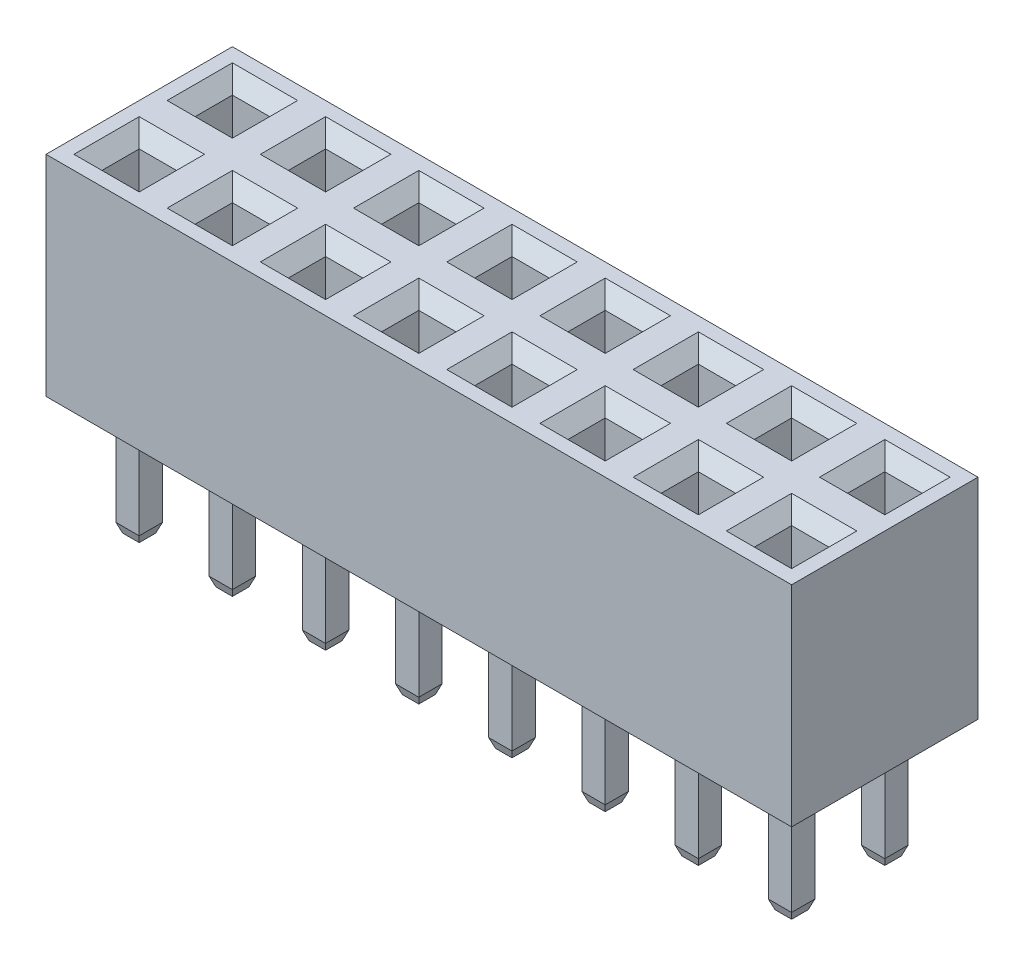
from build123d import *
from OCP.BRepFilletAPI import BRepFilletAPI_MakeChamfer

# Parameters (mm, degrees)
SKETCH_2_W                          = 2
SKETCH_2_H                          = 4
EXTRUDE_2_DEPTH                     = 4.5
SKETCH_3_W                          = 0.8
SKETCH_3_H                          = 0.8
CUT_EXTRUDE_1_DEPTH                 = 4
CHAMFER_3_SIZE                      = 0.3
SKETCH_1_W                          = 0.5
SKETCH_1_H                          = 0.5
EXTRUDE_1_DEPTH                     = 2.54
CHAMFER_1_SIZE                      = 0.2
CHAMFER_1_SIZE2                     = 0.072794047
PATTERN_LINEAR_1_COUNT              = 8
PATTERN_LINEAR_1_PITCH              = 2
CHAMFER_3_OF_PATTERN_LINEAR_1_SIZE  = 0.3
PATTERN_LINEAR_3_COUNT              = 100
PATTERN_LINEAR_3_PITCH              = 2
CHAMFER_1_OF_PATTERN_LINEAR_3_SIZE  = 0.2
CHAMFER_1_OF_PATTERN_LINEAR_3_SIZE2 = 0.072794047


with BuildPart() as part:
    # Sketch 2 → Extrude 2 (new body)
    with BuildSketch(Plane(origin=(0, 0, 0), x_dir=(1, 0, 0), z_dir=(0, 1, 0))):
        with Locations((0, 1)):
            Rectangle(SKETCH_2_W, SKETCH_2_H)
    extrude_2 = extrude(amount=EXTRUDE_2_DEPTH)

    # Sketch 3 → Cut-Extrude 1 (cut)
    with BuildSketch(Plane(origin=(0, 4.5, 0), x_dir=(-1, 0, 0), z_dir=(0, 1, 0))):
        Rectangle(SKETCH_3_W, SKETCH_3_H)
        with Locations((0, -2)):
            Rectangle(SKETCH_3_W, SKETCH_3_H)
    cut_extrude_1 = extrude(amount=-CUT_EXTRUDE_1_DEPTH, mode=Mode.SUBTRACT)

    # Chamfer 3
    chamfer_3_edges = [part.edges().sort_by_distance(p)[0] for p in [
        (-0.4, 4.5, 0),
        (0, 4.5, 0.4),
        (0.4, 4.5, 0),
        (0, 4.5, -0.4),
        (-0.4, 4.5, -2),
        (0, 4.5, -1.6),
        (0.4, 4.5, -2),
        (0, 4.5, -2.4),
    ]]
    chamfer(chamfer_3_edges, length=CHAMFER_3_SIZE)

    # Sketch 1 → Extrude 1 (add)
    with BuildSketch(Plane(origin=(0, 0, 0), x_dir=(1, 0, 0), z_dir=(0, 1, 0))):
        Rectangle(SKETCH_1_W, SKETCH_1_H)
        with Locations((0, 2)):
            Rectangle(SKETCH_1_W, SKETCH_1_H)
    extrude_1 = extrude(amount=-EXTRUDE_1_DEPTH)

    # Chamfer 1: one chamfer whose edges measure the first distance from different faces: ONE call of the kernel's chamfer builder (chamfer() names one face for all edges)
    chamfer_1_edges_1 = [part.edges().sort_by_distance(p)[0] for p in [
        (-0.25, -2.54, 0),
    ]]
    chamfer_1_side_1 = [part.faces().sort_by_distance(p)[0] for p in [
        (-0.25, -1.27, 0),
    ]]
    chamfer_1_edges_2 = [part.edges().sort_by_distance(p)[0] for p in [
        (0, -2.54, -0.25),
    ]]
    chamfer_1_side_2 = [part.faces().sort_by_distance(p)[0] for p in [
        (0, -1.27, -0.25),
    ]]
    chamfer_1_edges_3 = [part.edges().sort_by_distance(p)[0] for p in [
        (0.25, -2.54, 0),
    ]]
    chamfer_1_side_3 = [part.faces().sort_by_distance(p)[0] for p in [
        (0.25, -1.27, 0),
    ]]
    chamfer_1_edges_4 = [part.edges().sort_by_distance(p)[0] for p in [
        (0, -2.54, 0.25),
    ]]
    chamfer_1_side_4 = [part.faces().sort_by_distance(p)[0] for p in [
        (0, -1.27, 0.25),
    ]]
    chamfer_1_edges_5 = [part.edges().sort_by_distance(p)[0] for p in [
        (-0.25, -2.54, -2),
    ]]
    chamfer_1_side_5 = [part.faces().sort_by_distance(p)[0] for p in [
        (-0.25, -1.27, -2),
    ]]
    chamfer_1_edges_6 = [part.edges().sort_by_distance(p)[0] for p in [
        (0, -2.54, -2.25),
    ]]
    chamfer_1_side_6 = [part.faces().sort_by_distance(p)[0] for p in [
        (0, -1.27, -2.25),
    ]]
    chamfer_1_edges_7 = [part.edges().sort_by_distance(p)[0] for p in [
        (0.25, -2.54, -2),
    ]]
    chamfer_1_side_7 = [part.faces().sort_by_distance(p)[0] for p in [
        (0.25, -1.27, -2),
    ]]
    chamfer_1_edges_8 = [part.edges().sort_by_distance(p)[0] for p in [
        (0, -2.54, -1.75),
    ]]
    chamfer_1_side_8 = [part.faces().sort_by_distance(p)[0] for p in [
        (0, -1.27, -1.75),
    ]]
    chamfer_1 = BRepFilletAPI_MakeChamfer(part.part.solid().wrapped)
    for e in chamfer_1_edges_1:
        chamfer_1.Add(CHAMFER_1_SIZE, CHAMFER_1_SIZE2, e.wrapped, chamfer_1_side_1[0].wrapped)  # the first distance lies on this face
    for e in chamfer_1_edges_2:
        chamfer_1.Add(CHAMFER_1_SIZE, CHAMFER_1_SIZE2, e.wrapped, chamfer_1_side_2[0].wrapped)  # the first distance lies on this face
    for e in chamfer_1_edges_3:
        chamfer_1.Add(CHAMFER_1_SIZE, CHAMFER_1_SIZE2, e.wrapped, chamfer_1_side_3[0].wrapped)  # the first distance lies on this face
    for e in chamfer_1_edges_4:
        chamfer_1.Add(CHAMFER_1_SIZE, CHAMFER_1_SIZE2, e.wrapped, chamfer_1_side_4[0].wrapped)  # the first distance lies on this face
    for e in chamfer_1_edges_5:
        chamfer_1.Add(CHAMFER_1_SIZE, CHAMFER_1_SIZE2, e.wrapped, chamfer_1_side_5[0].wrapped)  # the first distance lies on this face
    for e in chamfer_1_edges_6:
        chamfer_1.Add(CHAMFER_1_SIZE, CHAMFER_1_SIZE2, e.wrapped, chamfer_1_side_6[0].wrapped)  # the first distance lies on this face
    for e in chamfer_1_edges_7:
        chamfer_1.Add(CHAMFER_1_SIZE, CHAMFER_1_SIZE2, e.wrapped, chamfer_1_side_7[0].wrapped)  # the first distance lies on this face
    for e in chamfer_1_edges_8:
        chamfer_1.Add(CHAMFER_1_SIZE, CHAMFER_1_SIZE2, e.wrapped, chamfer_1_side_8[0].wrapped)  # the first distance lies on this face
    add(Compound.cast(chamfer_1.Shape()), mode=Mode.REPLACE)

    # Pattern Linear 1: Extrude 2, Cut-Extrude 1 ×8
    with Locations(*[(-i * PATTERN_LINEAR_1_PITCH, 0, 0) for i in range(1, PATTERN_LINEAR_1_COUNT)]):
        add(extrude_2)
        add(cut_extrude_1, mode=Mode.SUBTRACT)

    # Chamfer 3 of Pattern Linear 1
    chamfer_3_of_pattern_linear_1_edges = [part.edges().sort_by_distance(p)[0] for p in [
        (-2.4, 4.5, 0),
        (-2, 4.5, 0.4),
        (-1.6, 4.5, 0),
        (-2, 4.5, -0.4),
        (-2.4, 4.5, -2),
        (-2, 4.5, -1.6),
        (-1.6, 4.5, -2),
        (-2, 4.5, -2.4),
        (-4.4, 4.5, 0),
        (-4, 4.5, 0.4),
        (-3.6, 4.5, 0),
        (-4, 4.5, -0.4),
        (-4.4, 4.5, -2),
        (-4, 4.5, -1.6),
        (-3.6, 4.5, -2),
        (-4, 4.5, -2.4),
        (-6.4, 4.5, 0),
        (-6, 4.5, 0.4),
        (-5.6, 4.5, 0),
        (-6, 4.5, -0.4),
        (-6.4, 4.5, -2),
        (-6, 4.5, -1.6),
        (-5.6, 4.5, -2),
        (-6, 4.5, -2.4),
        (-8.4, 4.5, 0),
        (-8, 4.5, 0.4),
        (-7.6, 4.5, 0),
        (-8, 4.5, -0.4),
        (-8.4, 4.5, -2),
        (-8, 4.5, -1.6),
        (-7.6, 4.5, -2),
        (-8, 4.5, -2.4),
        (-10.4, 4.5, 0),
        (-10, 4.5, 0.4),
        (-9.6, 4.5, 0),
        (-10, 4.5, -0.4),
        (-10.4, 4.5, -2),
        (-10, 4.5, -1.6),
        (-9.6, 4.5, -2),
        (-10, 4.5, -2.4),
        (-12.4, 4.5, 0),
        (-12, 4.5, 0.4),
        (-11.6, 4.5, 0),
        (-12, 4.5, -0.4),
        (-12.4, 4.5, -2),
        (-12, 4.5, -1.6),
        (-11.6, 4.5, -2),
        (-12, 4.5, -2.4),
        (-14.4, 4.5, 0),
        (-14, 4.5, 0.4),
        (-13.6, 4.5, 0),
        (-14, 4.5, -0.4),
        (-14.4, 4.5, -2),
        (-14, 4.5, -1.6),
        (-13.6, 4.5, -2),
        (-14, 4.5, -2.4),
    ]]
    chamfer(chamfer_3_of_pattern_linear_1_edges, length=CHAMFER_3_OF_PATTERN_LINEAR_1_SIZE)

    # Pattern Linear 3: Extrude 1 ×100, 92 skipped
    with Locations(*[(-i * PATTERN_LINEAR_3_PITCH, 0, 0) for i in range(1, PATTERN_LINEAR_3_COUNT) if i not in (8, 9, 10, 11, 12, 13, 14, 15, 16, 17, 18, 19, 20, 21, 22, 23, 24, 25, 26, 27, 28, 29, 30, 31, 32, 33, 34, 35, 36, 37, 38, 39, 40, 41, 42, 43, 44, 45, 46, 47, 48, 49, 50, 51, 52, 53, 54, 55, 56, 57, 58, 59, 60, 61, 62, 63, 64, 65, 66, 67, 68, 69, 70, 71, 72, 73, 74, 75, 76, 77, 78, 79, 80, 81, 82, 83, 84, 85, 86, 87, 88, 89, 90, 91, 92, 93, 94, 95, 96, 97, 98, 99)]):
        add(extrude_1)

    # Chamfer 1 of Pattern Linear 3: one chamfer whose edges measure the first distance from different faces: ONE call of the kernel's chamfer builder (chamfer() names one face for all edges)
    chamfer_1_of_pattern_linear_3_edges_1 = [part.edges().sort_by_distance(p)[0] for p in [
        (-2.25, -2.54, 0),
    ]]
    chamfer_1_of_pattern_linear_3_side_1 = [part.faces().sort_by_distance(p)[0] for p in [
        (-2.25, -1.27, 0),
    ]]
    chamfer_1_of_pattern_linear_3_edges_2 = [part.edges().sort_by_distance(p)[0] for p in [
        (-2, -2.54, -0.25),
    ]]
    chamfer_1_of_pattern_linear_3_side_2 = [part.faces().sort_by_distance(p)[0] for p in [
        (-2, -1.27, -0.25),
    ]]
    chamfer_1_of_pattern_linear_3_edges_3 = [part.edges().sort_by_distance(p)[0] for p in [
        (-1.75, -2.54, 0),
    ]]
    chamfer_1_of_pattern_linear_3_side_3 = [part.faces().sort_by_distance(p)[0] for p in [
        (-1.75, -1.27, 0),
    ]]
    chamfer_1_of_pattern_linear_3_edges_4 = [part.edges().sort_by_distance(p)[0] for p in [
        (-2, -2.54, 0.25),
    ]]
    chamfer_1_of_pattern_linear_3_side_4 = [part.faces().sort_by_distance(p)[0] for p in [
        (-2, -1.27, 0.25),
    ]]
    chamfer_1_of_pattern_linear_3_edges_5 = [part.edges().sort_by_distance(p)[0] for p in [
        (-2.25, -2.54, -2),
    ]]
    chamfer_1_of_pattern_linear_3_side_5 = [part.faces().sort_by_distance(p)[0] for p in [
        (-2.25, -1.27, -2),
    ]]
    chamfer_1_of_pattern_linear_3_edges_6 = [part.edges().sort_by_distance(p)[0] for p in [
        (-2, -2.54, -2.25),
    ]]
    chamfer_1_of_pattern_linear_3_side_6 = [part.faces().sort_by_distance(p)[0] for p in [
        (-2, -1.27, -2.25),
    ]]
    chamfer_1_of_pattern_linear_3_edges_7 = [part.edges().sort_by_distance(p)[0] for p in [
        (-1.75, -2.54, -2),
    ]]
    chamfer_1_of_pattern_linear_3_side_7 = [part.faces().sort_by_distance(p)[0] for p in [
        (-1.75, -1.27, -2),
    ]]
    chamfer_1_of_pattern_linear_3_edges_8 = [part.edges().sort_by_distance(p)[0] for p in [
        (-2, -2.54, -1.75),
    ]]
    chamfer_1_of_pattern_linear_3_side_8 = [part.faces().sort_by_distance(p)[0] for p in [
        (-2, -1.27, -1.75),
    ]]
    chamfer_1_of_pattern_linear_3_edges_9 = [part.edges().sort_by_distance(p)[0] for p in [
        (-4.25, -2.54, 0),
    ]]
    chamfer_1_of_pattern_linear_3_side_9 = [part.faces().sort_by_distance(p)[0] for p in [
        (-4.25, -1.27, 0),
    ]]
    chamfer_1_of_pattern_linear_3_edges_10 = [part.edges().sort_by_distance(p)[0] for p in [
        (-4, -2.54, -0.25),
    ]]
    chamfer_1_of_pattern_linear_3_side_10 = [part.faces().sort_by_distance(p)[0] for p in [
        (-4, -1.27, -0.25),
    ]]
    chamfer_1_of_pattern_linear_3_edges_11 = [part.edges().sort_by_distance(p)[0] for p in [
        (-3.75, -2.54, 0),
    ]]
    chamfer_1_of_pattern_linear_3_side_11 = [part.faces().sort_by_distance(p)[0] for p in [
        (-3.75, -1.27, 0),
    ]]
    chamfer_1_of_pattern_linear_3_edges_12 = [part.edges().sort_by_distance(p)[0] for p in [
        (-4, -2.54, 0.25),
    ]]
    chamfer_1_of_pattern_linear_3_side_12 = [part.faces().sort_by_distance(p)[0] for p in [
        (-4, -1.27, 0.25),
    ]]
    chamfer_1_of_pattern_linear_3_edges_13 = [part.edges().sort_by_distance(p)[0] for p in [
        (-4.25, -2.54, -2),
    ]]
    chamfer_1_of_pattern_linear_3_side_13 = [part.faces().sort_by_distance(p)[0] for p in [
        (-4.25, -1.27, -2),
    ]]
    chamfer_1_of_pattern_linear_3_edges_14 = [part.edges().sort_by_distance(p)[0] for p in [
        (-4, -2.54, -2.25),
    ]]
    chamfer_1_of_pattern_linear_3_side_14 = [part.faces().sort_by_distance(p)[0] for p in [
        (-4, -1.27, -2.25),
    ]]
    chamfer_1_of_pattern_linear_3_edges_15 = [part.edges().sort_by_distance(p)[0] for p in [
        (-3.75, -2.54, -2),
    ]]
    chamfer_1_of_pattern_linear_3_side_15 = [part.faces().sort_by_distance(p)[0] for p in [
        (-3.75, -1.27, -2),
    ]]
    chamfer_1_of_pattern_linear_3_edges_16 = [part.edges().sort_by_distance(p)[0] for p in [
        (-4, -2.54, -1.75),
    ]]
    chamfer_1_of_pattern_linear_3_side_16 = [part.faces().sort_by_distance(p)[0] for p in [
        (-4, -1.27, -1.75),
    ]]
    chamfer_1_of_pattern_linear_3_edges_17 = [part.edges().sort_by_distance(p)[0] for p in [
        (-6.25, -2.54, 0),
    ]]
    chamfer_1_of_pattern_linear_3_side_17 = [part.faces().sort_by_distance(p)[0] for p in [
        (-6.25, -1.27, 0),
    ]]
    chamfer_1_of_pattern_linear_3_edges_18 = [part.edges().sort_by_distance(p)[0] for p in [
        (-6, -2.54, -0.25),
    ]]
    chamfer_1_of_pattern_linear_3_side_18 = [part.faces().sort_by_distance(p)[0] for p in [
        (-6, -1.27, -0.25),
    ]]
    chamfer_1_of_pattern_linear_3_edges_19 = [part.edges().sort_by_distance(p)[0] for p in [
        (-5.75, -2.54, 0),
    ]]
    chamfer_1_of_pattern_linear_3_side_19 = [part.faces().sort_by_distance(p)[0] for p in [
        (-5.75, -1.27, 0),
    ]]
    chamfer_1_of_pattern_linear_3_edges_20 = [part.edges().sort_by_distance(p)[0] for p in [
        (-6, -2.54, 0.25),
    ]]
    chamfer_1_of_pattern_linear_3_side_20 = [part.faces().sort_by_distance(p)[0] for p in [
        (-6, -1.27, 0.25),
    ]]
    chamfer_1_of_pattern_linear_3_edges_21 = [part.edges().sort_by_distance(p)[0] for p in [
        (-6.25, -2.54, -2),
    ]]
    chamfer_1_of_pattern_linear_3_side_21 = [part.faces().sort_by_distance(p)[0] for p in [
        (-6.25, -1.27, -2),
    ]]
    chamfer_1_of_pattern_linear_3_edges_22 = [part.edges().sort_by_distance(p)[0] for p in [
        (-6, -2.54, -2.25),
    ]]
    chamfer_1_of_pattern_linear_3_side_22 = [part.faces().sort_by_distance(p)[0] for p in [
        (-6, -1.27, -2.25),
    ]]
    chamfer_1_of_pattern_linear_3_edges_23 = [part.edges().sort_by_distance(p)[0] for p in [
        (-5.75, -2.54, -2),
    ]]
    chamfer_1_of_pattern_linear_3_side_23 = [part.faces().sort_by_distance(p)[0] for p in [
        (-5.75, -1.27, -2),
    ]]
    chamfer_1_of_pattern_linear_3_edges_24 = [part.edges().sort_by_distance(p)[0] for p in [
        (-6, -2.54, -1.75),
    ]]
    chamfer_1_of_pattern_linear_3_side_24 = [part.faces().sort_by_distance(p)[0] for p in [
        (-6, -1.27, -1.75),
    ]]
    chamfer_1_of_pattern_linear_3_edges_25 = [part.edges().sort_by_distance(p)[0] for p in [
        (-8.25, -2.54, 0),
    ]]
    chamfer_1_of_pattern_linear_3_side_25 = [part.faces().sort_by_distance(p)[0] for p in [
        (-8.25, -1.27, 0),
    ]]
    chamfer_1_of_pattern_linear_3_edges_26 = [part.edges().sort_by_distance(p)[0] for p in [
        (-8, -2.54, -0.25),
    ]]
    chamfer_1_of_pattern_linear_3_side_26 = [part.faces().sort_by_distance(p)[0] for p in [
        (-8, -1.27, -0.25),
    ]]
    chamfer_1_of_pattern_linear_3_edges_27 = [part.edges().sort_by_distance(p)[0] for p in [
        (-7.75, -2.54, 0),
    ]]
    chamfer_1_of_pattern_linear_3_side_27 = [part.faces().sort_by_distance(p)[0] for p in [
        (-7.75, -1.27, 0),
    ]]
    chamfer_1_of_pattern_linear_3_edges_28 = [part.edges().sort_by_distance(p)[0] for p in [
        (-8, -2.54, 0.25),
    ]]
    chamfer_1_of_pattern_linear_3_side_28 = [part.faces().sort_by_distance(p)[0] for p in [
        (-8, -1.27, 0.25),
    ]]
    chamfer_1_of_pattern_linear_3_edges_29 = [part.edges().sort_by_distance(p)[0] for p in [
        (-8.25, -2.54, -2),
    ]]
    chamfer_1_of_pattern_linear_3_side_29 = [part.faces().sort_by_distance(p)[0] for p in [
        (-8.25, -1.27, -2),
    ]]
    chamfer_1_of_pattern_linear_3_edges_30 = [part.edges().sort_by_distance(p)[0] for p in [
        (-8, -2.54, -2.25),
    ]]
    chamfer_1_of_pattern_linear_3_side_30 = [part.faces().sort_by_distance(p)[0] for p in [
        (-8, -1.27, -2.25),
    ]]
    chamfer_1_of_pattern_linear_3_edges_31 = [part.edges().sort_by_distance(p)[0] for p in [
        (-7.75, -2.54, -2),
    ]]
    chamfer_1_of_pattern_linear_3_side_31 = [part.faces().sort_by_distance(p)[0] for p in [
        (-7.75, -1.27, -2),
    ]]
    chamfer_1_of_pattern_linear_3_edges_32 = [part.edges().sort_by_distance(p)[0] for p in [
        (-8, -2.54, -1.75),
    ]]
    chamfer_1_of_pattern_linear_3_side_32 = [part.faces().sort_by_distance(p)[0] for p in [
        (-8, -1.27, -1.75),
    ]]
    chamfer_1_of_pattern_linear_3_edges_33 = [part.edges().sort_by_distance(p)[0] for p in [
        (-10.25, -2.54, 0),
    ]]
    chamfer_1_of_pattern_linear_3_side_33 = [part.faces().sort_by_distance(p)[0] for p in [
        (-10.25, -1.27, 0),
    ]]
    chamfer_1_of_pattern_linear_3_edges_34 = [part.edges().sort_by_distance(p)[0] for p in [
        (-10, -2.54, -0.25),
    ]]
    chamfer_1_of_pattern_linear_3_side_34 = [part.faces().sort_by_distance(p)[0] for p in [
        (-10, -1.27, -0.25),
    ]]
    chamfer_1_of_pattern_linear_3_edges_35 = [part.edges().sort_by_distance(p)[0] for p in [
        (-9.75, -2.54, 0),
    ]]
    chamfer_1_of_pattern_linear_3_side_35 = [part.faces().sort_by_distance(p)[0] for p in [
        (-9.75, -1.27, 0),
    ]]
    chamfer_1_of_pattern_linear_3_edges_36 = [part.edges().sort_by_distance(p)[0] for p in [
        (-10, -2.54, 0.25),
    ]]
    chamfer_1_of_pattern_linear_3_side_36 = [part.faces().sort_by_distance(p)[0] for p in [
        (-10, -1.27, 0.25),
    ]]
    chamfer_1_of_pattern_linear_3_edges_37 = [part.edges().sort_by_distance(p)[0] for p in [
        (-10.25, -2.54, -2),
    ]]
    chamfer_1_of_pattern_linear_3_side_37 = [part.faces().sort_by_distance(p)[0] for p in [
        (-10.25, -1.27, -2),
    ]]
    chamfer_1_of_pattern_linear_3_edges_38 = [part.edges().sort_by_distance(p)[0] for p in [
        (-10, -2.54, -2.25),
    ]]
    chamfer_1_of_pattern_linear_3_side_38 = [part.faces().sort_by_distance(p)[0] for p in [
        (-10, -1.27, -2.25),
    ]]
    chamfer_1_of_pattern_linear_3_edges_39 = [part.edges().sort_by_distance(p)[0] for p in [
        (-9.75, -2.54, -2),
    ]]
    chamfer_1_of_pattern_linear_3_side_39 = [part.faces().sort_by_distance(p)[0] for p in [
        (-9.75, -1.27, -2),
    ]]
    chamfer_1_of_pattern_linear_3_edges_40 = [part.edges().sort_by_distance(p)[0] for p in [
        (-10, -2.54, -1.75),
    ]]
    chamfer_1_of_pattern_linear_3_side_40 = [part.faces().sort_by_distance(p)[0] for p in [
        (-10, -1.27, -1.75),
    ]]
    chamfer_1_of_pattern_linear_3_edges_41 = [part.edges().sort_by_distance(p)[0] for p in [
        (-12.25, -2.54, 0),
    ]]
    chamfer_1_of_pattern_linear_3_side_41 = [part.faces().sort_by_distance(p)[0] for p in [
        (-12.25, -1.27, 0),
    ]]
    chamfer_1_of_pattern_linear_3_edges_42 = [part.edges().sort_by_distance(p)[0] for p in [
        (-12, -2.54, -0.25),
    ]]
    chamfer_1_of_pattern_linear_3_side_42 = [part.faces().sort_by_distance(p)[0] for p in [
        (-12, -1.27, -0.25),
    ]]
    chamfer_1_of_pattern_linear_3_edges_43 = [part.edges().sort_by_distance(p)[0] for p in [
        (-11.75, -2.54, 0),
    ]]
    chamfer_1_of_pattern_linear_3_side_43 = [part.faces().sort_by_distance(p)[0] for p in [
        (-11.75, -1.27, 0),
    ]]
    chamfer_1_of_pattern_linear_3_edges_44 = [part.edges().sort_by_distance(p)[0] for p in [
        (-12, -2.54, 0.25),
    ]]
    chamfer_1_of_pattern_linear_3_side_44 = [part.faces().sort_by_distance(p)[0] for p in [
        (-12, -1.27, 0.25),
    ]]
    chamfer_1_of_pattern_linear_3_edges_45 = [part.edges().sort_by_distance(p)[0] for p in [
        (-12.25, -2.54, -2),
    ]]
    chamfer_1_of_pattern_linear_3_side_45 = [part.faces().sort_by_distance(p)[0] for p in [
        (-12.25, -1.27, -2),
    ]]
    chamfer_1_of_pattern_linear_3_edges_46 = [part.edges().sort_by_distance(p)[0] for p in [
        (-12, -2.54, -2.25),
    ]]
    chamfer_1_of_pattern_linear_3_side_46 = [part.faces().sort_by_distance(p)[0] for p in [
        (-12, -1.27, -2.25),
    ]]
    chamfer_1_of_pattern_linear_3_edges_47 = [part.edges().sort_by_distance(p)[0] for p in [
        (-11.75, -2.54, -2),
    ]]
    chamfer_1_of_pattern_linear_3_side_47 = [part.faces().sort_by_distance(p)[0] for p in [
        (-11.75, -1.27, -2),
    ]]
    chamfer_1_of_pattern_linear_3_edges_48 = [part.edges().sort_by_distance(p)[0] for p in [
        (-12, -2.54, -1.75),
    ]]
    chamfer_1_of_pattern_linear_3_side_48 = [part.faces().sort_by_distance(p)[0] for p in [
        (-12, -1.27, -1.75),
    ]]
    chamfer_1_of_pattern_linear_3_edges_49 = [part.edges().sort_by_distance(p)[0] for p in [
        (-14.25, -2.54, 0),
    ]]
    chamfer_1_of_pattern_linear_3_side_49 = [part.faces().sort_by_distance(p)[0] for p in [
        (-14.25, -1.27, 0),
    ]]
    chamfer_1_of_pattern_linear_3_edges_50 = [part.edges().sort_by_distance(p)[0] for p in [
        (-14, -2.54, -0.25),
    ]]
    chamfer_1_of_pattern_linear_3_side_50 = [part.faces().sort_by_distance(p)[0] for p in [
        (-14, -1.27, -0.25),
    ]]
    chamfer_1_of_pattern_linear_3_edges_51 = [part.edges().sort_by_distance(p)[0] for p in [
        (-13.75, -2.54, 0),
    ]]
    chamfer_1_of_pattern_linear_3_side_51 = [part.faces().sort_by_distance(p)[0] for p in [
        (-13.75, -1.27, 0),
    ]]
    chamfer_1_of_pattern_linear_3_edges_52 = [part.edges().sort_by_distance(p)[0] for p in [
        (-14, -2.54, 0.25),
    ]]
    chamfer_1_of_pattern_linear_3_side_52 = [part.faces().sort_by_distance(p)[0] for p in [
        (-14, -1.27, 0.25),
    ]]
    chamfer_1_of_pattern_linear_3_edges_53 = [part.edges().sort_by_distance(p)[0] for p in [
        (-14.25, -2.54, -2),
    ]]
    chamfer_1_of_pattern_linear_3_side_53 = [part.faces().sort_by_distance(p)[0] for p in [
        (-14.25, -1.27, -2),
    ]]
    chamfer_1_of_pattern_linear_3_edges_54 = [part.edges().sort_by_distance(p)[0] for p in [
        (-14, -2.54, -2.25),
    ]]
    chamfer_1_of_pattern_linear_3_side_54 = [part.faces().sort_by_distance(p)[0] for p in [
        (-14, -1.27, -2.25),
    ]]
    chamfer_1_of_pattern_linear_3_edges_55 = [part.edges().sort_by_distance(p)[0] for p in [
        (-13.75, -2.54, -2),
    ]]
    chamfer_1_of_pattern_linear_3_side_55 = [part.faces().sort_by_distance(p)[0] for p in [
        (-13.75, -1.27, -2),
    ]]
    chamfer_1_of_pattern_linear_3_edges_56 = [part.edges().sort_by_distance(p)[0] for p in [
        (-14, -2.54, -1.75),
    ]]
    chamfer_1_of_pattern_linear_3_side_56 = [part.faces().sort_by_distance(p)[0] for p in [
        (-14, -1.27, -1.75),
    ]]
    chamfer_1_of_pattern_linear_3 = BRepFilletAPI_MakeChamfer(part.part.solid().wrapped)
    for e in chamfer_1_of_pattern_linear_3_edges_1:
        chamfer_1_of_pattern_linear_3.Add(CHAMFER_1_OF_PATTERN_LINEAR_3_SIZE, CHAMFER_1_OF_PATTERN_LINEAR_3_SIZE2, e.wrapped, chamfer_1_of_pattern_linear_3_side_1[0].wrapped)  # the first distance lies on this face
    for e in chamfer_1_of_pattern_linear_3_edges_2:
        chamfer_1_of_pattern_linear_3.Add(CHAMFER_1_OF_PATTERN_LINEAR_3_SIZE, CHAMFER_1_OF_PATTERN_LINEAR_3_SIZE2, e.wrapped, chamfer_1_of_pattern_linear_3_side_2[0].wrapped)  # the first distance lies on this face
    for e in chamfer_1_of_pattern_linear_3_edges_3:
        chamfer_1_of_pattern_linear_3.Add(CHAMFER_1_OF_PATTERN_LINEAR_3_SIZE, CHAMFER_1_OF_PATTERN_LINEAR_3_SIZE2, e.wrapped, chamfer_1_of_pattern_linear_3_side_3[0].wrapped)  # the first distance lies on this face
    for e in chamfer_1_of_pattern_linear_3_edges_4:
        chamfer_1_of_pattern_linear_3.Add(CHAMFER_1_OF_PATTERN_LINEAR_3_SIZE, CHAMFER_1_OF_PATTERN_LINEAR_3_SIZE2, e.wrapped, chamfer_1_of_pattern_linear_3_side_4[0].wrapped)  # the first distance lies on this face
    for e in chamfer_1_of_pattern_linear_3_edges_5:
        chamfer_1_of_pattern_linear_3.Add(CHAMFER_1_OF_PATTERN_LINEAR_3_SIZE, CHAMFER_1_OF_PATTERN_LINEAR_3_SIZE2, e.wrapped, chamfer_1_of_pattern_linear_3_side_5[0].wrapped)  # the first distance lies on this face
    for e in chamfer_1_of_pattern_linear_3_edges_6:
        chamfer_1_of_pattern_linear_3.Add(CHAMFER_1_OF_PATTERN_LINEAR_3_SIZE, CHAMFER_1_OF_PATTERN_LINEAR_3_SIZE2, e.wrapped, chamfer_1_of_pattern_linear_3_side_6[0].wrapped)  # the first distance lies on this face
    for e in chamfer_1_of_pattern_linear_3_edges_7:
        chamfer_1_of_pattern_linear_3.Add(CHAMFER_1_OF_PATTERN_LINEAR_3_SIZE, CHAMFER_1_OF_PATTERN_LINEAR_3_SIZE2, e.wrapped, chamfer_1_of_pattern_linear_3_side_7[0].wrapped)  # the first distance lies on this face
    for e in chamfer_1_of_pattern_linear_3_edges_8:
        chamfer_1_of_pattern_linear_3.Add(CHAMFER_1_OF_PATTERN_LINEAR_3_SIZE, CHAMFER_1_OF_PATTERN_LINEAR_3_SIZE2, e.wrapped, chamfer_1_of_pattern_linear_3_side_8[0].wrapped)  # the first distance lies on this face
    for e in chamfer_1_of_pattern_linear_3_edges_9:
        chamfer_1_of_pattern_linear_3.Add(CHAMFER_1_OF_PATTERN_LINEAR_3_SIZE, CHAMFER_1_OF_PATTERN_LINEAR_3_SIZE2, e.wrapped, chamfer_1_of_pattern_linear_3_side_9[0].wrapped)  # the first distance lies on this face
    for e in chamfer_1_of_pattern_linear_3_edges_10:
        chamfer_1_of_pattern_linear_3.Add(CHAMFER_1_OF_PATTERN_LINEAR_3_SIZE, CHAMFER_1_OF_PATTERN_LINEAR_3_SIZE2, e.wrapped, chamfer_1_of_pattern_linear_3_side_10[0].wrapped)  # the first distance lies on this face
    for e in chamfer_1_of_pattern_linear_3_edges_11:
        chamfer_1_of_pattern_linear_3.Add(CHAMFER_1_OF_PATTERN_LINEAR_3_SIZE, CHAMFER_1_OF_PATTERN_LINEAR_3_SIZE2, e.wrapped, chamfer_1_of_pattern_linear_3_side_11[0].wrapped)  # the first distance lies on this face
    for e in chamfer_1_of_pattern_linear_3_edges_12:
        chamfer_1_of_pattern_linear_3.Add(CHAMFER_1_OF_PATTERN_LINEAR_3_SIZE, CHAMFER_1_OF_PATTERN_LINEAR_3_SIZE2, e.wrapped, chamfer_1_of_pattern_linear_3_side_12[0].wrapped)  # the first distance lies on this face
    for e in chamfer_1_of_pattern_linear_3_edges_13:
        chamfer_1_of_pattern_linear_3.Add(CHAMFER_1_OF_PATTERN_LINEAR_3_SIZE, CHAMFER_1_OF_PATTERN_LINEAR_3_SIZE2, e.wrapped, chamfer_1_of_pattern_linear_3_side_13[0].wrapped)  # the first distance lies on this face
    for e in chamfer_1_of_pattern_linear_3_edges_14:
        chamfer_1_of_pattern_linear_3.Add(CHAMFER_1_OF_PATTERN_LINEAR_3_SIZE, CHAMFER_1_OF_PATTERN_LINEAR_3_SIZE2, e.wrapped, chamfer_1_of_pattern_linear_3_side_14[0].wrapped)  # the first distance lies on this face
    for e in chamfer_1_of_pattern_linear_3_edges_15:
        chamfer_1_of_pattern_linear_3.Add(CHAMFER_1_OF_PATTERN_LINEAR_3_SIZE, CHAMFER_1_OF_PATTERN_LINEAR_3_SIZE2, e.wrapped, chamfer_1_of_pattern_linear_3_side_15[0].wrapped)  # the first distance lies on this face
    for e in chamfer_1_of_pattern_linear_3_edges_16:
        chamfer_1_of_pattern_linear_3.Add(CHAMFER_1_OF_PATTERN_LINEAR_3_SIZE, CHAMFER_1_OF_PATTERN_LINEAR_3_SIZE2, e.wrapped, chamfer_1_of_pattern_linear_3_side_16[0].wrapped)  # the first distance lies on this face
    for e in chamfer_1_of_pattern_linear_3_edges_17:
        chamfer_1_of_pattern_linear_3.Add(CHAMFER_1_OF_PATTERN_LINEAR_3_SIZE, CHAMFER_1_OF_PATTERN_LINEAR_3_SIZE2, e.wrapped, chamfer_1_of_pattern_linear_3_side_17[0].wrapped)  # the first distance lies on this face
    for e in chamfer_1_of_pattern_linear_3_edges_18:
        chamfer_1_of_pattern_linear_3.Add(CHAMFER_1_OF_PATTERN_LINEAR_3_SIZE, CHAMFER_1_OF_PATTERN_LINEAR_3_SIZE2, e.wrapped, chamfer_1_of_pattern_linear_3_side_18[0].wrapped)  # the first distance lies on this face
    for e in chamfer_1_of_pattern_linear_3_edges_19:
        chamfer_1_of_pattern_linear_3.Add(CHAMFER_1_OF_PATTERN_LINEAR_3_SIZE, CHAMFER_1_OF_PATTERN_LINEAR_3_SIZE2, e.wrapped, chamfer_1_of_pattern_linear_3_side_19[0].wrapped)  # the first distance lies on this face
    for e in chamfer_1_of_pattern_linear_3_edges_20:
        chamfer_1_of_pattern_linear_3.Add(CHAMFER_1_OF_PATTERN_LINEAR_3_SIZE, CHAMFER_1_OF_PATTERN_LINEAR_3_SIZE2, e.wrapped, chamfer_1_of_pattern_linear_3_side_20[0].wrapped)  # the first distance lies on this face
    for e in chamfer_1_of_pattern_linear_3_edges_21:
        chamfer_1_of_pattern_linear_3.Add(CHAMFER_1_OF_PATTERN_LINEAR_3_SIZE, CHAMFER_1_OF_PATTERN_LINEAR_3_SIZE2, e.wrapped, chamfer_1_of_pattern_linear_3_side_21[0].wrapped)  # the first distance lies on this face
    for e in chamfer_1_of_pattern_linear_3_edges_22:
        chamfer_1_of_pattern_linear_3.Add(CHAMFER_1_OF_PATTERN_LINEAR_3_SIZE, CHAMFER_1_OF_PATTERN_LINEAR_3_SIZE2, e.wrapped, chamfer_1_of_pattern_linear_3_side_22[0].wrapped)  # the first distance lies on this face
    for e in chamfer_1_of_pattern_linear_3_edges_23:
        chamfer_1_of_pattern_linear_3.Add(CHAMFER_1_OF_PATTERN_LINEAR_3_SIZE, CHAMFER_1_OF_PATTERN_LINEAR_3_SIZE2, e.wrapped, chamfer_1_of_pattern_linear_3_side_23[0].wrapped)  # the first distance lies on this face
    for e in chamfer_1_of_pattern_linear_3_edges_24:
        chamfer_1_of_pattern_linear_3.Add(CHAMFER_1_OF_PATTERN_LINEAR_3_SIZE, CHAMFER_1_OF_PATTERN_LINEAR_3_SIZE2, e.wrapped, chamfer_1_of_pattern_linear_3_side_24[0].wrapped)  # the first distance lies on this face
    for e in chamfer_1_of_pattern_linear_3_edges_25:
        chamfer_1_of_pattern_linear_3.Add(CHAMFER_1_OF_PATTERN_LINEAR_3_SIZE, CHAMFER_1_OF_PATTERN_LINEAR_3_SIZE2, e.wrapped, chamfer_1_of_pattern_linear_3_side_25[0].wrapped)  # the first distance lies on this face
    for e in chamfer_1_of_pattern_linear_3_edges_26:
        chamfer_1_of_pattern_linear_3.Add(CHAMFER_1_OF_PATTERN_LINEAR_3_SIZE, CHAMFER_1_OF_PATTERN_LINEAR_3_SIZE2, e.wrapped, chamfer_1_of_pattern_linear_3_side_26[0].wrapped)  # the first distance lies on this face
    for e in chamfer_1_of_pattern_linear_3_edges_27:
        chamfer_1_of_pattern_linear_3.Add(CHAMFER_1_OF_PATTERN_LINEAR_3_SIZE, CHAMFER_1_OF_PATTERN_LINEAR_3_SIZE2, e.wrapped, chamfer_1_of_pattern_linear_3_side_27[0].wrapped)  # the first distance lies on this face
    for e in chamfer_1_of_pattern_linear_3_edges_28:
        chamfer_1_of_pattern_linear_3.Add(CHAMFER_1_OF_PATTERN_LINEAR_3_SIZE, CHAMFER_1_OF_PATTERN_LINEAR_3_SIZE2, e.wrapped, chamfer_1_of_pattern_linear_3_side_28[0].wrapped)  # the first distance lies on this face
    for e in chamfer_1_of_pattern_linear_3_edges_29:
        chamfer_1_of_pattern_linear_3.Add(CHAMFER_1_OF_PATTERN_LINEAR_3_SIZE, CHAMFER_1_OF_PATTERN_LINEAR_3_SIZE2, e.wrapped, chamfer_1_of_pattern_linear_3_side_29[0].wrapped)  # the first distance lies on this face
    for e in chamfer_1_of_pattern_linear_3_edges_30:
        chamfer_1_of_pattern_linear_3.Add(CHAMFER_1_OF_PATTERN_LINEAR_3_SIZE, CHAMFER_1_OF_PATTERN_LINEAR_3_SIZE2, e.wrapped, chamfer_1_of_pattern_linear_3_side_30[0].wrapped)  # the first distance lies on this face
    for e in chamfer_1_of_pattern_linear_3_edges_31:
        chamfer_1_of_pattern_linear_3.Add(CHAMFER_1_OF_PATTERN_LINEAR_3_SIZE, CHAMFER_1_OF_PATTERN_LINEAR_3_SIZE2, e.wrapped, chamfer_1_of_pattern_linear_3_side_31[0].wrapped)  # the first distance lies on this face
    for e in chamfer_1_of_pattern_linear_3_edges_32:
        chamfer_1_of_pattern_linear_3.Add(CHAMFER_1_OF_PATTERN_LINEAR_3_SIZE, CHAMFER_1_OF_PATTERN_LINEAR_3_SIZE2, e.wrapped, chamfer_1_of_pattern_linear_3_side_32[0].wrapped)  # the first distance lies on this face
    for e in chamfer_1_of_pattern_linear_3_edges_33:
        chamfer_1_of_pattern_linear_3.Add(CHAMFER_1_OF_PATTERN_LINEAR_3_SIZE, CHAMFER_1_OF_PATTERN_LINEAR_3_SIZE2, e.wrapped, chamfer_1_of_pattern_linear_3_side_33[0].wrapped)  # the first distance lies on this face
    for e in chamfer_1_of_pattern_linear_3_edges_34:
        chamfer_1_of_pattern_linear_3.Add(CHAMFER_1_OF_PATTERN_LINEAR_3_SIZE, CHAMFER_1_OF_PATTERN_LINEAR_3_SIZE2, e.wrapped, chamfer_1_of_pattern_linear_3_side_34[0].wrapped)  # the first distance lies on this face
    for e in chamfer_1_of_pattern_linear_3_edges_35:
        chamfer_1_of_pattern_linear_3.Add(CHAMFER_1_OF_PATTERN_LINEAR_3_SIZE, CHAMFER_1_OF_PATTERN_LINEAR_3_SIZE2, e.wrapped, chamfer_1_of_pattern_linear_3_side_35[0].wrapped)  # the first distance lies on this face
    for e in chamfer_1_of_pattern_linear_3_edges_36:
        chamfer_1_of_pattern_linear_3.Add(CHAMFER_1_OF_PATTERN_LINEAR_3_SIZE, CHAMFER_1_OF_PATTERN_LINEAR_3_SIZE2, e.wrapped, chamfer_1_of_pattern_linear_3_side_36[0].wrapped)  # the first distance lies on this face
    for e in chamfer_1_of_pattern_linear_3_edges_37:
        chamfer_1_of_pattern_linear_3.Add(CHAMFER_1_OF_PATTERN_LINEAR_3_SIZE, CHAMFER_1_OF_PATTERN_LINEAR_3_SIZE2, e.wrapped, chamfer_1_of_pattern_linear_3_side_37[0].wrapped)  # the first distance lies on this face
    for e in chamfer_1_of_pattern_linear_3_edges_38:
        chamfer_1_of_pattern_linear_3.Add(CHAMFER_1_OF_PATTERN_LINEAR_3_SIZE, CHAMFER_1_OF_PATTERN_LINEAR_3_SIZE2, e.wrapped, chamfer_1_of_pattern_linear_3_side_38[0].wrapped)  # the first distance lies on this face
    for e in chamfer_1_of_pattern_linear_3_edges_39:
        chamfer_1_of_pattern_linear_3.Add(CHAMFER_1_OF_PATTERN_LINEAR_3_SIZE, CHAMFER_1_OF_PATTERN_LINEAR_3_SIZE2, e.wrapped, chamfer_1_of_pattern_linear_3_side_39[0].wrapped)  # the first distance lies on this face
    for e in chamfer_1_of_pattern_linear_3_edges_40:
        chamfer_1_of_pattern_linear_3.Add(CHAMFER_1_OF_PATTERN_LINEAR_3_SIZE, CHAMFER_1_OF_PATTERN_LINEAR_3_SIZE2, e.wrapped, chamfer_1_of_pattern_linear_3_side_40[0].wrapped)  # the first distance lies on this face
    for e in chamfer_1_of_pattern_linear_3_edges_41:
        chamfer_1_of_pattern_linear_3.Add(CHAMFER_1_OF_PATTERN_LINEAR_3_SIZE, CHAMFER_1_OF_PATTERN_LINEAR_3_SIZE2, e.wrapped, chamfer_1_of_pattern_linear_3_side_41[0].wrapped)  # the first distance lies on this face
    for e in chamfer_1_of_pattern_linear_3_edges_42:
        chamfer_1_of_pattern_linear_3.Add(CHAMFER_1_OF_PATTERN_LINEAR_3_SIZE, CHAMFER_1_OF_PATTERN_LINEAR_3_SIZE2, e.wrapped, chamfer_1_of_pattern_linear_3_side_42[0].wrapped)  # the first distance lies on this face
    for e in chamfer_1_of_pattern_linear_3_edges_43:
        chamfer_1_of_pattern_linear_3.Add(CHAMFER_1_OF_PATTERN_LINEAR_3_SIZE, CHAMFER_1_OF_PATTERN_LINEAR_3_SIZE2, e.wrapped, chamfer_1_of_pattern_linear_3_side_43[0].wrapped)  # the first distance lies on this face
    for e in chamfer_1_of_pattern_linear_3_edges_44:
        chamfer_1_of_pattern_linear_3.Add(CHAMFER_1_OF_PATTERN_LINEAR_3_SIZE, CHAMFER_1_OF_PATTERN_LINEAR_3_SIZE2, e.wrapped, chamfer_1_of_pattern_linear_3_side_44[0].wrapped)  # the first distance lies on this face
    for e in chamfer_1_of_pattern_linear_3_edges_45:
        chamfer_1_of_pattern_linear_3.Add(CHAMFER_1_OF_PATTERN_LINEAR_3_SIZE, CHAMFER_1_OF_PATTERN_LINEAR_3_SIZE2, e.wrapped, chamfer_1_of_pattern_linear_3_side_45[0].wrapped)  # the first distance lies on this face
    for e in chamfer_1_of_pattern_linear_3_edges_46:
        chamfer_1_of_pattern_linear_3.Add(CHAMFER_1_OF_PATTERN_LINEAR_3_SIZE, CHAMFER_1_OF_PATTERN_LINEAR_3_SIZE2, e.wrapped, chamfer_1_of_pattern_linear_3_side_46[0].wrapped)  # the first distance lies on this face
    for e in chamfer_1_of_pattern_linear_3_edges_47:
        chamfer_1_of_pattern_linear_3.Add(CHAMFER_1_OF_PATTERN_LINEAR_3_SIZE, CHAMFER_1_OF_PATTERN_LINEAR_3_SIZE2, e.wrapped, chamfer_1_of_pattern_linear_3_side_47[0].wrapped)  # the first distance lies on this face
    for e in chamfer_1_of_pattern_linear_3_edges_48:
        chamfer_1_of_pattern_linear_3.Add(CHAMFER_1_OF_PATTERN_LINEAR_3_SIZE, CHAMFER_1_OF_PATTERN_LINEAR_3_SIZE2, e.wrapped, chamfer_1_of_pattern_linear_3_side_48[0].wrapped)  # the first distance lies on this face
    for e in chamfer_1_of_pattern_linear_3_edges_49:
        chamfer_1_of_pattern_linear_3.Add(CHAMFER_1_OF_PATTERN_LINEAR_3_SIZE, CHAMFER_1_OF_PATTERN_LINEAR_3_SIZE2, e.wrapped, chamfer_1_of_pattern_linear_3_side_49[0].wrapped)  # the first distance lies on this face
    for e in chamfer_1_of_pattern_linear_3_edges_50:
        chamfer_1_of_pattern_linear_3.Add(CHAMFER_1_OF_PATTERN_LINEAR_3_SIZE, CHAMFER_1_OF_PATTERN_LINEAR_3_SIZE2, e.wrapped, chamfer_1_of_pattern_linear_3_side_50[0].wrapped)  # the first distance lies on this face
    for e in chamfer_1_of_pattern_linear_3_edges_51:
        chamfer_1_of_pattern_linear_3.Add(CHAMFER_1_OF_PATTERN_LINEAR_3_SIZE, CHAMFER_1_OF_PATTERN_LINEAR_3_SIZE2, e.wrapped, chamfer_1_of_pattern_linear_3_side_51[0].wrapped)  # the first distance lies on this face
    for e in chamfer_1_of_pattern_linear_3_edges_52:
        chamfer_1_of_pattern_linear_3.Add(CHAMFER_1_OF_PATTERN_LINEAR_3_SIZE, CHAMFER_1_OF_PATTERN_LINEAR_3_SIZE2, e.wrapped, chamfer_1_of_pattern_linear_3_side_52[0].wrapped)  # the first distance lies on this face
    for e in chamfer_1_of_pattern_linear_3_edges_53:
        chamfer_1_of_pattern_linear_3.Add(CHAMFER_1_OF_PATTERN_LINEAR_3_SIZE, CHAMFER_1_OF_PATTERN_LINEAR_3_SIZE2, e.wrapped, chamfer_1_of_pattern_linear_3_side_53[0].wrapped)  # the first distance lies on this face
    for e in chamfer_1_of_pattern_linear_3_edges_54:
        chamfer_1_of_pattern_linear_3.Add(CHAMFER_1_OF_PATTERN_LINEAR_3_SIZE, CHAMFER_1_OF_PATTERN_LINEAR_3_SIZE2, e.wrapped, chamfer_1_of_pattern_linear_3_side_54[0].wrapped)  # the first distance lies on this face
    for e in chamfer_1_of_pattern_linear_3_edges_55:
        chamfer_1_of_pattern_linear_3.Add(CHAMFER_1_OF_PATTERN_LINEAR_3_SIZE, CHAMFER_1_OF_PATTERN_LINEAR_3_SIZE2, e.wrapped, chamfer_1_of_pattern_linear_3_side_55[0].wrapped)  # the first distance lies on this face
    for e in chamfer_1_of_pattern_linear_3_edges_56:
        chamfer_1_of_pattern_linear_3.Add(CHAMFER_1_OF_PATTERN_LINEAR_3_SIZE, CHAMFER_1_OF_PATTERN_LINEAR_3_SIZE2, e.wrapped, chamfer_1_of_pattern_linear_3_side_56[0].wrapped)  # the first distance lies on this face
    add(Compound.cast(chamfer_1_of_pattern_linear_3.Shape()), mode=Mode.REPLACE)


solid = part.part
